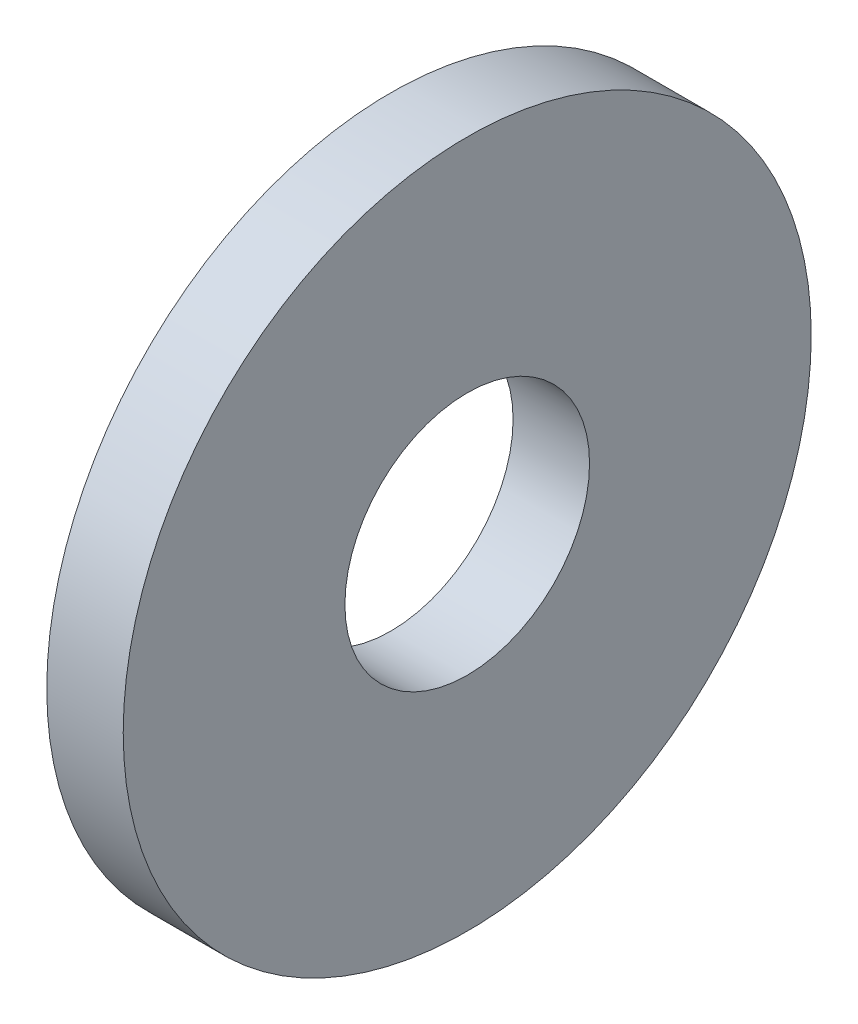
ISO-10303-21;
HEADER;
FILE_DESCRIPTION(('STEP AP214'),'2;1');
FILE_NAME('part.step','',(''),(''),'','','');
FILE_SCHEMA(('AUTOMOTIVE_DESIGN { 1 0 10303 214 1 1 1 1 }'));
ENDSEC;
DATA;
#1=APPLICATION_CONTEXT('core data for automotive mechanical design processes');
#2=APPLICATION_PROTOCOL_DEFINITION('international standard','automotive_design',2000,#1);
#3=PRODUCT_CONTEXT('',#1,'mechanical');
#4=PRODUCT('Part','Part','',(#3));
#5=PRODUCT_RELATED_PRODUCT_CATEGORY('part','',(#4));
#6=PRODUCT_DEFINITION_FORMATION('','',#4);
#7=PRODUCT_DEFINITION_CONTEXT('part definition',#1,'design');
#8=PRODUCT_DEFINITION('design','',#6,#7);
#9=PRODUCT_DEFINITION_SHAPE('','',#8);
#10=(LENGTH_UNIT() NAMED_UNIT(*) SI_UNIT(.MILLI.,.METRE.));
#11=(NAMED_UNIT(*) PLANE_ANGLE_UNIT() SI_UNIT($,.RADIAN.));
#12=(NAMED_UNIT(*) SI_UNIT($,.STERADIAN.) SOLID_ANGLE_UNIT());
#13=UNCERTAINTY_MEASURE_WITH_UNIT(LENGTH_MEASURE(1.E-05),#10,'distance_accuracy_value','');
#14=(GEOMETRIC_REPRESENTATION_CONTEXT(3) GLOBAL_UNCERTAINTY_ASSIGNED_CONTEXT((#13)) GLOBAL_UNIT_ASSIGNED_CONTEXT((#10,
#11,#12)) REPRESENTATION_CONTEXT('',''));
#15=CARTESIAN_POINT('',(0.,0.,0.));
#16=DIRECTION('',(0.,0.,1.));
#17=DIRECTION('',(1.,0.,0.));
#18=AXIS2_PLACEMENT_3D('',#15,#16,#17);
#19=CARTESIAN_POINT('',(0.,0.,-9.));
#20=DIRECTION('',(1.,0.,0.));
#21=DIRECTION('',(0.,0.,-1.));
#22=AXIS2_PLACEMENT_3D('',#19,#20,#21);
#23=PLANE('',#22);
#24=CARTESIAN_POINT('',(0.,0.,0.));
#25=DIRECTION('',(-1.,0.,0.));
#26=DIRECTION('',(0.,0.,1.));
#27=AXIS2_PLACEMENT_3D('',#24,#25,#26);
#28=CIRCLE('',#27,3.2);
#29=CARTESIAN_POINT('',(0.,0.,3.2));
#30=VERTEX_POINT('',#29);
#31=EDGE_CURVE('E10',#30,#30,#28,.T.);
#32=ORIENTED_EDGE('',*,*,#31,.F.);
#33=EDGE_LOOP('',(#32));
#34=FACE_BOUND('',#33,.T.);
#35=CARTESIAN_POINT('',(0.,0.,0.));
#36=DIRECTION('',(-1.,0.,0.));
#37=DIRECTION('',(0.,0.,1.));
#38=AXIS2_PLACEMENT_3D('',#35,#36,#37);
#39=CIRCLE('',#38,9.);
#40=CARTESIAN_POINT('',(0.,0.,9.));
#41=VERTEX_POINT('',#40);
#42=EDGE_CURVE('E44',#41,#41,#39,.T.);
#43=ORIENTED_EDGE('',*,*,#42,.T.);
#44=EDGE_LOOP('',(#43));
#45=FACE_BOUND('',#44,.T.);
#46=ADVANCED_FACE('F30',(#34,#45),#23,.F.);
#47=CARTESIAN_POINT('',(0.,0.,0.));
#48=DIRECTION('',(-1.,0.,0.));
#49=DIRECTION('',(0.,0.,1.));
#50=AXIS2_PLACEMENT_3D('',#47,#48,#49);
#51=CYLINDRICAL_SURFACE('',#50,3.2);
#52=CARTESIAN_POINT('',(2.,0.,0.));
#53=DIRECTION('',(-1.,0.,0.));
#54=DIRECTION('',(0.,0.,1.));
#55=AXIS2_PLACEMENT_3D('',#52,#53,#54);
#56=CIRCLE('',#55,3.2);
#57=CARTESIAN_POINT('',(2.,0.,3.2));
#58=VERTEX_POINT('',#57);
#59=EDGE_CURVE('E36',#58,#58,#56,.T.);
#60=ORIENTED_EDGE('',*,*,#59,.F.);
#61=EDGE_LOOP('',(#60));
#62=FACE_BOUND('',#61,.T.);
#63=ORIENTED_EDGE('',*,*,#31,.T.);
#64=EDGE_LOOP('',(#63));
#65=FACE_BOUND('',#64,.T.);
#66=ADVANCED_FACE('F59',(#62,#65),#51,.F.);
#67=CARTESIAN_POINT('',(2.,0.,-9.));
#68=DIRECTION('',(-1.,0.,0.));
#69=DIRECTION('',(0.,0.,1.));
#70=AXIS2_PLACEMENT_3D('',#67,#68,#69);
#71=PLANE('',#70);
#72=CARTESIAN_POINT('',(2.,0.,0.));
#73=DIRECTION('',(-1.,0.,0.));
#74=DIRECTION('',(0.,0.,1.));
#75=AXIS2_PLACEMENT_3D('',#72,#73,#74);
#76=CIRCLE('',#75,9.);
#77=CARTESIAN_POINT('',(2.,0.,9.));
#78=VERTEX_POINT('',#77);
#79=EDGE_CURVE('E40',#78,#78,#76,.T.);
#80=ORIENTED_EDGE('',*,*,#79,.F.);
#81=EDGE_LOOP('',(#80));
#82=FACE_BOUND('',#81,.T.);
#83=ORIENTED_EDGE('',*,*,#59,.T.);
#84=EDGE_LOOP('',(#83));
#85=FACE_BOUND('',#84,.T.);
#86=ADVANCED_FACE('F54',(#82,#85),#71,.F.);
#87=CARTESIAN_POINT('',(0.,0.,0.));
#88=DIRECTION('',(-1.,0.,0.));
#89=DIRECTION('',(0.,0.,1.));
#90=AXIS2_PLACEMENT_3D('',#87,#88,#89);
#91=CYLINDRICAL_SURFACE('',#90,9.);
#92=ORIENTED_EDGE('',*,*,#42,.F.);
#93=EDGE_LOOP('',(#92));
#94=FACE_BOUND('',#93,.T.);
#95=ORIENTED_EDGE('',*,*,#79,.T.);
#96=EDGE_LOOP('',(#95));
#97=FACE_BOUND('',#96,.T.);
#98=ADVANCED_FACE('F51',(#94,#97),#91,.T.);
#99=CLOSED_SHELL('',(#46,#66,#86,#98));
#100=MANIFOLD_SOLID_BREP('B2',#99);
#101=ADVANCED_BREP_SHAPE_REPRESENTATION('',(#18,#100),#14);
#102=SHAPE_DEFINITION_REPRESENTATION(#9,#101);
ENDSEC;
END-ISO-10303-21;
